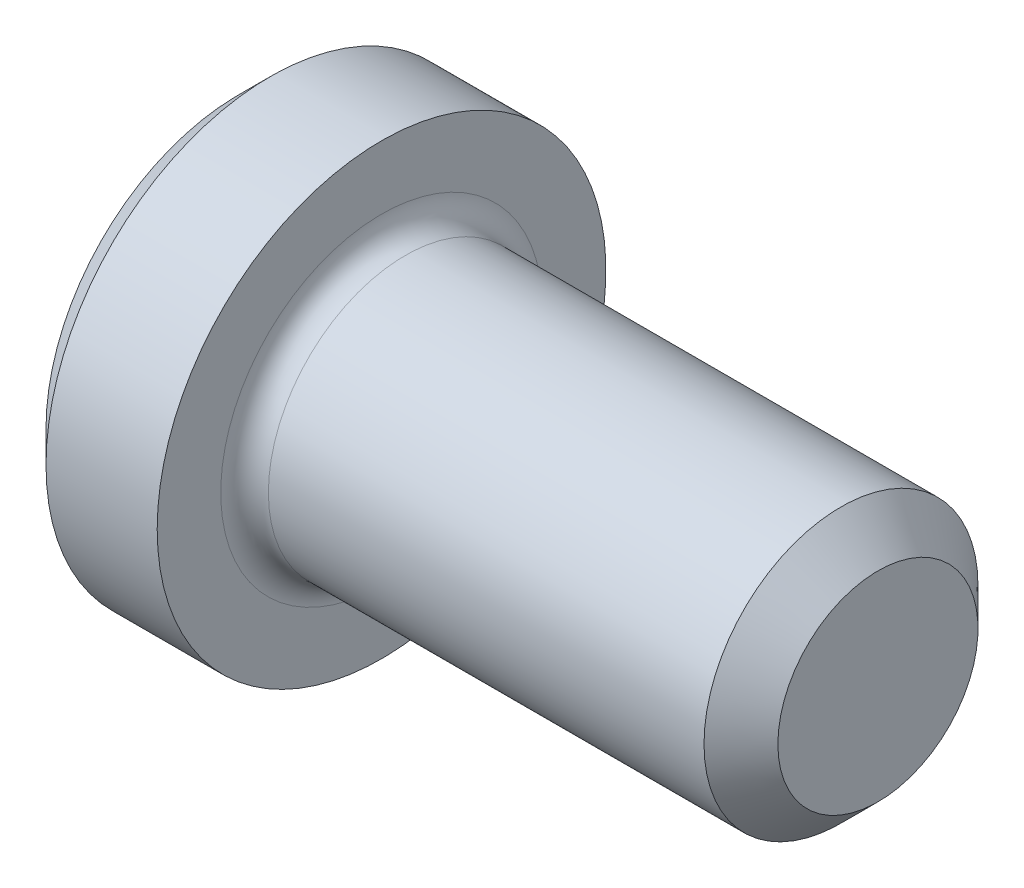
ISO-10303-21;
HEADER;
FILE_DESCRIPTION(('STEP AP214'),'2;1');
FILE_NAME('part.step','',(''),(''),'','','');
FILE_SCHEMA(('AUTOMOTIVE_DESIGN { 1 0 10303 214 1 1 1 1 }'));
ENDSEC;
DATA;
#1=APPLICATION_CONTEXT('core data for automotive mechanical design processes');
#2=APPLICATION_PROTOCOL_DEFINITION('international standard','automotive_design',2000,#1);
#3=PRODUCT_CONTEXT('',#1,'mechanical');
#4=PRODUCT('Part','Part','',(#3));
#5=PRODUCT_RELATED_PRODUCT_CATEGORY('part','',(#4));
#6=PRODUCT_DEFINITION_FORMATION('','',#4);
#7=PRODUCT_DEFINITION_CONTEXT('part definition',#1,'design');
#8=PRODUCT_DEFINITION('design','',#6,#7);
#9=PRODUCT_DEFINITION_SHAPE('','',#8);
#10=(LENGTH_UNIT() NAMED_UNIT(*) SI_UNIT(.MILLI.,.METRE.));
#11=(NAMED_UNIT(*) PLANE_ANGLE_UNIT() SI_UNIT($,.RADIAN.));
#12=(NAMED_UNIT(*) SI_UNIT($,.STERADIAN.) SOLID_ANGLE_UNIT());
#13=UNCERTAINTY_MEASURE_WITH_UNIT(LENGTH_MEASURE(1.E-05),#10,'distance_accuracy_value','');
#14=(GEOMETRIC_REPRESENTATION_CONTEXT(3) GLOBAL_UNCERTAINTY_ASSIGNED_CONTEXT((#13)) GLOBAL_UNIT_ASSIGNED_CONTEXT((#10,
#11,#12)) REPRESENTATION_CONTEXT('',''));
#15=CARTESIAN_POINT('',(0.,0.,0.));
#16=DIRECTION('',(0.,0.,1.));
#17=DIRECTION('',(1.,0.,0.));
#18=AXIS2_PLACEMENT_3D('',#15,#16,#17);
#19=CARTESIAN_POINT('',(0.,0.,0.));
#20=DIRECTION('',(-1.,0.,0.));
#21=DIRECTION('',(0.,0.,1.));
#22=AXIS2_PLACEMENT_3D('',#19,#20,#21);
#23=PLANE('',#22);
#24=DIRECTION('',(0.,-0.499999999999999,0.866025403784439));
#25=VECTOR('',#24,1.);
#26=CARTESIAN_POINT('',(0.,0.909211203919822,0.));
#27=LINE('',#26,#25);
#28=CARTESIAN_POINT('',(0.,0.909211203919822,0.));
#29=VERTEX_POINT('',#28);
#30=CARTESIAN_POINT('',(0.,0.454605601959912,0.787399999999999));
#31=VERTEX_POINT('',#30);
#32=EDGE_CURVE('E268',#29,#31,#27,.T.);
#33=ORIENTED_EDGE('',*,*,#32,.T.);
#34=DIRECTION('',(0.,1.,0.));
#35=VECTOR('',#34,1.);
#36=CARTESIAN_POINT('',(0.,-0.45460560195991,0.7874));
#37=LINE('',#36,#35);
#38=CARTESIAN_POINT('',(0.,-0.45460560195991,0.7874));
#39=VERTEX_POINT('',#38);
#40=EDGE_CURVE('E128',#39,#31,#37,.T.);
#41=ORIENTED_EDGE('',*,*,#40,.F.);
#42=DIRECTION('',(0.,-0.500000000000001,-0.866025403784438));
#43=VECTOR('',#42,1.);
#44=CARTESIAN_POINT('',(0.,-0.45460560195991,0.7874));
#45=LINE('',#44,#43);
#46=CARTESIAN_POINT('',(0.,-0.909211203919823,0.));
#47=VERTEX_POINT('',#46);
#48=EDGE_CURVE('E271',#39,#47,#45,.T.);
#49=ORIENTED_EDGE('',*,*,#48,.T.);
#50=DIRECTION('',(0.,0.499999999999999,-0.866025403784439));
#51=VECTOR('',#50,1.);
#52=CARTESIAN_POINT('',(0.,-0.909211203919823,0.));
#53=LINE('',#52,#51);
#54=CARTESIAN_POINT('',(0.,-0.454605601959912,-0.787399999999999));
#55=VERTEX_POINT('',#54);
#56=EDGE_CURVE('E274',#47,#55,#53,.T.);
#57=ORIENTED_EDGE('',*,*,#56,.T.);
#58=DIRECTION('',(0.,-1.,0.));
#59=VECTOR('',#58,1.);
#60=CARTESIAN_POINT('',(0.,0.45460560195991,-0.787400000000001));
#61=LINE('',#60,#59);
#62=CARTESIAN_POINT('',(0.,0.45460560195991,-0.787400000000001));
#63=VERTEX_POINT('',#62);
#64=EDGE_CURVE('E277',#63,#55,#61,.T.);
#65=ORIENTED_EDGE('',*,*,#64,.F.);
#66=DIRECTION('',(0.,-0.500000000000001,-0.866025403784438));
#67=VECTOR('',#66,1.);
#68=CARTESIAN_POINT('',(0.,0.909211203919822,0.));
#69=LINE('',#68,#67);
#70=EDGE_CURVE('E123',#29,#63,#69,.T.);
#71=ORIENTED_EDGE('',*,*,#70,.F.);
#72=EDGE_LOOP('',(#33,#41,#49,#57,#65,#71));
#73=FACE_BOUND('',#72,.T.);
#74=CARTESIAN_POINT('',(0.,0.,0.));
#75=DIRECTION('',(-1.,0.,0.));
#76=DIRECTION('',(0.,0.,1.));
#77=AXIS2_PLACEMENT_3D('',#74,#75,#76);
#78=CIRCLE('',#77,2.4638);
#79=CARTESIAN_POINT('',(0.,0.,2.4638));
#80=VERTEX_POINT('',#79);
#81=EDGE_CURVE('E152',#80,#80,#78,.T.);
#82=ORIENTED_EDGE('',*,*,#81,.T.);
#83=EDGE_LOOP('',(#82));
#84=FACE_BOUND('',#83,.T.);
#85=ADVANCED_FACE('F36',(#73,#84),#23,.T.);
#86=CARTESIAN_POINT('',(0.,0.,0.));
#87=DIRECTION('',(1.,0.,0.));
#88=DIRECTION('',(0.,0.,-1.));
#89=AXIS2_PLACEMENT_3D('',#86,#87,#88);
#90=CONICAL_SURFACE('',#89,2.4638,0.785398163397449);
#91=CARTESIAN_POINT('',(0.406400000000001,0.,0.));
#92=DIRECTION('',(-1.,0.,0.));
#93=DIRECTION('',(0.,0.,1.));
#94=AXIS2_PLACEMENT_3D('',#91,#92,#93);
#95=CIRCLE('',#94,2.8702);
#96=CARTESIAN_POINT('',(0.406400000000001,0.,2.8702));
#97=VERTEX_POINT('',#96);
#98=EDGE_CURVE('E149',#97,#97,#95,.T.);
#99=ORIENTED_EDGE('',*,*,#98,.T.);
#100=EDGE_LOOP('',(#99));
#101=FACE_BOUND('',#100,.T.);
#102=ORIENTED_EDGE('',*,*,#81,.F.);
#103=EDGE_LOOP('',(#102));
#104=FACE_BOUND('',#103,.T.);
#105=ADVANCED_FACE('F173',(#101,#104),#90,.T.);
#106=CARTESIAN_POINT('',(-5.43092971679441,0.,0.));
#107=DIRECTION('',(-1.,0.,0.));
#108=DIRECTION('',(0.,0.,1.));
#109=AXIS2_PLACEMENT_3D('',#106,#107,#108);
#110=CYLINDRICAL_SURFACE('',#109,2.8702);
#111=CARTESIAN_POINT('',(1.8288,0.,0.));
#112=DIRECTION('',(-1.,0.,0.));
#113=DIRECTION('',(0.,0.,1.));
#114=AXIS2_PLACEMENT_3D('',#111,#112,#113);
#115=CIRCLE('',#114,2.8702);
#116=CARTESIAN_POINT('',(1.8288,0.,2.8702));
#117=VERTEX_POINT('',#116);
#118=EDGE_CURVE('E146',#117,#117,#115,.T.);
#119=ORIENTED_EDGE('',*,*,#118,.T.);
#120=EDGE_LOOP('',(#119));
#121=FACE_BOUND('',#120,.T.);
#122=ORIENTED_EDGE('',*,*,#98,.F.);
#123=EDGE_LOOP('',(#122));
#124=FACE_BOUND('',#123,.T.);
#125=ADVANCED_FACE('F178',(#121,#124),#110,.T.);
#126=CARTESIAN_POINT('',(1.8288,2.8702,0.));
#127=DIRECTION('',(1.,0.,0.));
#128=DIRECTION('',(0.,0.,-1.));
#129=AXIS2_PLACEMENT_3D('',#126,#127,#128);
#130=PLANE('',#129);
#131=CARTESIAN_POINT('',(1.8288,0.,0.));
#132=DIRECTION('',(1.,0.,0.));
#133=DIRECTION('',(0.,0.,-1.));
#134=AXIS2_PLACEMENT_3D('',#131,#132,#133);
#135=CIRCLE('',#134,2.0574);
#136=CARTESIAN_POINT('',(1.8288,0.,-2.0574));
#137=VERTEX_POINT('',#136);
#138=EDGE_CURVE('E44',#137,#137,#135,.F.);
#139=ORIENTED_EDGE('',*,*,#138,.T.);
#140=EDGE_LOOP('',(#139));
#141=FACE_BOUND('',#140,.T.);
#142=ORIENTED_EDGE('',*,*,#118,.F.);
#143=EDGE_LOOP('',(#142));
#144=FACE_BOUND('',#143,.T.);
#145=ADVANCED_FACE('F157',(#141,#144),#130,.T.);
#146=CARTESIAN_POINT('',(-5.43092971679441,0.,0.));
#147=DIRECTION('',(-1.,0.,0.));
#148=DIRECTION('',(0.,0.,1.));
#149=AXIS2_PLACEMENT_3D('',#146,#147,#148);
#150=CYLINDRICAL_SURFACE('',#149,1.7526);
#151=CARTESIAN_POINT('',(2.1336,0.,0.));
#152=DIRECTION('',(1.,0.,0.));
#153=DIRECTION('',(0.,0.,-1.));
#154=AXIS2_PLACEMENT_3D('',#151,#152,#153);
#155=CIRCLE('',#154,1.7526);
#156=CARTESIAN_POINT('',(2.1336,0.,-1.7526));
#157=VERTEX_POINT('',#156);
#158=EDGE_CURVE('E11',#157,#157,#155,.T.);
#159=ORIENTED_EDGE('',*,*,#158,.T.);
#160=EDGE_LOOP('',(#159));
#161=FACE_BOUND('',#160,.T.);
#162=CARTESIAN_POINT('',(7.70636000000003,0.,0.));
#163=DIRECTION('',(-1.,0.,0.));
#164=DIRECTION('',(0.,0.,1.));
#165=AXIS2_PLACEMENT_3D('',#162,#163,#164);
#166=CIRCLE('',#165,1.7526);
#167=CARTESIAN_POINT('',(7.70636000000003,0.,1.7526));
#168=VERTEX_POINT('',#167);
#169=EDGE_CURVE('E143',#168,#168,#166,.T.);
#170=ORIENTED_EDGE('',*,*,#169,.T.);
#171=EDGE_LOOP('',(#170));
#172=FACE_BOUND('',#171,.T.);
#173=ADVANCED_FACE('F188',(#161,#172),#150,.T.);
#174=CARTESIAN_POINT('',(8.17879999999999,0.,0.));
#175=DIRECTION('',(-1.,0.,0.));
#176=DIRECTION('',(0.,0.,1.));
#177=AXIS2_PLACEMENT_3D('',#174,#175,#176);
#178=CONICAL_SURFACE('',#177,1.28016000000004,0.785398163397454);
#179=ORIENTED_EDGE('',*,*,#169,.F.);
#180=EDGE_LOOP('',(#179));
#181=FACE_BOUND('',#180,.T.);
#182=CARTESIAN_POINT('',(8.17879999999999,0.,0.));
#183=DIRECTION('',(-1.,0.,0.));
#184=DIRECTION('',(0.,0.,1.));
#185=AXIS2_PLACEMENT_3D('',#182,#183,#184);
#186=CIRCLE('',#185,1.28016000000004);
#187=CARTESIAN_POINT('',(8.17879999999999,0.,1.28016000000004));
#188=VERTEX_POINT('',#187);
#189=EDGE_CURVE('E139',#188,#188,#186,.T.);
#190=ORIENTED_EDGE('',*,*,#189,.T.);
#191=EDGE_LOOP('',(#190));
#192=FACE_BOUND('',#191,.T.);
#193=ADVANCED_FACE('F168',(#181,#192),#178,.T.);
#194=CARTESIAN_POINT('',(8.1788,1.28016000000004,0.));
#195=DIRECTION('',(1.,0.,0.));
#196=DIRECTION('',(0.,0.,-1.));
#197=AXIS2_PLACEMENT_3D('',#194,#195,#196);
#198=PLANE('',#197);
#199=ORIENTED_EDGE('',*,*,#189,.F.);
#200=EDGE_LOOP('',(#199));
#201=FACE_BOUND('',#200,.T.);
#202=ADVANCED_FACE('F161',(#201),#198,.T.);
#203=CARTESIAN_POINT('',(2.1336,0.,0.));
#204=DIRECTION('',(1.,0.,0.));
#205=DIRECTION('',(0.,0.,-1.));
#206=AXIS2_PLACEMENT_3D('',#203,#204,#205);
#207=TOROIDAL_SURFACE('',#206,2.0574,0.3048);
#208=ORIENTED_EDGE('',*,*,#158,.F.);
#209=EDGE_LOOP('',(#208));
#210=FACE_BOUND('',#209,.T.);
#211=ORIENTED_EDGE('',*,*,#138,.F.);
#212=EDGE_LOOP('',(#211));
#213=FACE_BOUND('',#212,.T.);
#214=ADVANCED_FACE('F38',(#210,#213),#207,.F.);
#215=CARTESIAN_POINT('',(1.5748,0.909211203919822,0.));
#216=DIRECTION('',(0.,-0.866025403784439,-0.499999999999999));
#217=DIRECTION('',(0.,0.499999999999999,-0.866025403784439));
#218=AXIS2_PLACEMENT_3D('',#215,#216,#217);
#219=PLANE('',#218);
#220=ORIENTED_EDGE('',*,*,#32,.F.);
#221=DIRECTION('',(-1.,0.,0.));
#222=VECTOR('',#221,1.);
#223=CARTESIAN_POINT('',(1.5748,0.909211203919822,0.));
#224=LINE('',#223,#222);
#225=CARTESIAN_POINT('',(1.5748,0.909211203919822,0.));
#226=VERTEX_POINT('',#225);
#227=EDGE_CURVE('E267',#226,#29,#224,.T.);
#228=ORIENTED_EDGE('',*,*,#227,.F.);
#229=DIRECTION('',(0.,-0.499999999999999,0.866025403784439));
#230=VECTOR('',#229,1.);
#231=CARTESIAN_POINT('',(1.5748,0.909211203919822,0.));
#232=LINE('',#231,#230);
#233=CARTESIAN_POINT('',(1.5748,0.681908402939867,0.393699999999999));
#234=VERTEX_POINT('',#233);
#235=EDGE_CURVE('E51',#226,#234,#232,.T.);
#236=ORIENTED_EDGE('',*,*,#235,.T.);
#237=CARTESIAN_POINT('',(1.5748,0.454605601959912,0.787399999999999));
#238=VERTEX_POINT('',#237);
#239=EDGE_CURVE('E109',#234,#238,#232,.T.);
#240=ORIENTED_EDGE('',*,*,#239,.T.);
#241=DIRECTION('',(-1.,0.,0.));
#242=VECTOR('',#241,1.);
#243=CARTESIAN_POINT('',(1.5748,0.454605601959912,0.787399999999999));
#244=LINE('',#243,#242);
#245=EDGE_CURVE('E121',#238,#31,#244,.T.);
#246=ORIENTED_EDGE('',*,*,#245,.T.);
#247=EDGE_LOOP('',(#220,#228,#236,#240,#246));
#248=FACE_BOUND('',#247,.T.);
#249=ADVANCED_FACE('F120',(#248),#219,.T.);
#250=CARTESIAN_POINT('',(1.5748,-0.45460560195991,0.7874));
#251=DIRECTION('',(0.,0.,1.));
#252=DIRECTION('',(0.,-1.,0.));
#253=AXIS2_PLACEMENT_3D('',#250,#251,#252);
#254=PLANE('',#253);
#255=ORIENTED_EDGE('',*,*,#40,.T.);
#256=ORIENTED_EDGE('',*,*,#245,.F.);
#257=DIRECTION('',(0.,1.,0.));
#258=VECTOR('',#257,1.);
#259=CARTESIAN_POINT('',(1.5748,-0.45460560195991,0.7874));
#260=LINE('',#259,#258);
#261=CARTESIAN_POINT('',(1.5748,0.,0.7874));
#262=VERTEX_POINT('',#261);
#263=EDGE_CURVE('E107',#262,#238,#260,.T.);
#264=ORIENTED_EDGE('',*,*,#263,.F.);
#265=CARTESIAN_POINT('',(1.5748,-0.45460560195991,0.7874));
#266=VERTEX_POINT('',#265);
#267=EDGE_CURVE('E117',#266,#262,#260,.T.);
#268=ORIENTED_EDGE('',*,*,#267,.F.);
#269=DIRECTION('',(-1.,0.,0.));
#270=VECTOR('',#269,1.);
#271=CARTESIAN_POINT('',(1.5748,-0.45460560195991,0.7874));
#272=LINE('',#271,#270);
#273=EDGE_CURVE('E130',#266,#39,#272,.T.);
#274=ORIENTED_EDGE('',*,*,#273,.T.);
#275=EDGE_LOOP('',(#255,#256,#264,#268,#274));
#276=FACE_BOUND('',#275,.T.);
#277=ADVANCED_FACE('F125',(#276),#254,.F.);
#278=CARTESIAN_POINT('',(1.5748,-0.45460560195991,0.7874));
#279=DIRECTION('',(0.,0.866025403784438,-0.500000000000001));
#280=DIRECTION('',(0.,0.500000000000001,0.866025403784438));
#281=AXIS2_PLACEMENT_3D('',#278,#279,#280);
#282=PLANE('',#281);
#283=ORIENTED_EDGE('',*,*,#48,.F.);
#284=ORIENTED_EDGE('',*,*,#273,.F.);
#285=DIRECTION('',(0.,-0.500000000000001,-0.866025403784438));
#286=VECTOR('',#285,1.);
#287=CARTESIAN_POINT('',(1.5748,-0.45460560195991,0.7874));
#288=LINE('',#287,#286);
#289=CARTESIAN_POINT('',(1.5748,-0.681908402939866,0.393700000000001));
#290=VERTEX_POINT('',#289);
#291=EDGE_CURVE('E248',#266,#290,#288,.T.);
#292=ORIENTED_EDGE('',*,*,#291,.T.);
#293=CARTESIAN_POINT('',(1.5748,-0.909211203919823,0.));
#294=VERTEX_POINT('',#293);
#295=EDGE_CURVE('E250',#290,#294,#288,.T.);
#296=ORIENTED_EDGE('',*,*,#295,.T.);
#297=DIRECTION('',(-1.,0.,0.));
#298=VECTOR('',#297,1.);
#299=CARTESIAN_POINT('',(1.5748,-0.909211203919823,0.));
#300=LINE('',#299,#298);
#301=EDGE_CURVE('E135',#294,#47,#300,.T.);
#302=ORIENTED_EDGE('',*,*,#301,.T.);
#303=EDGE_LOOP('',(#283,#284,#292,#296,#302));
#304=FACE_BOUND('',#303,.T.);
#305=ADVANCED_FACE('F200',(#304),#282,.T.);
#306=CARTESIAN_POINT('',(1.5748,-0.909211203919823,0.));
#307=DIRECTION('',(0.,0.866025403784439,0.499999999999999));
#308=DIRECTION('',(0.,-0.499999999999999,0.866025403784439));
#309=AXIS2_PLACEMENT_3D('',#306,#307,#308);
#310=PLANE('',#309);
#311=ORIENTED_EDGE('',*,*,#56,.F.);
#312=ORIENTED_EDGE('',*,*,#301,.F.);
#313=DIRECTION('',(0.,0.499999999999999,-0.866025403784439));
#314=VECTOR('',#313,1.);
#315=CARTESIAN_POINT('',(1.5748,-0.909211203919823,0.));
#316=LINE('',#315,#314);
#317=CARTESIAN_POINT('',(1.5748,-0.681908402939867,-0.393699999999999));
#318=VERTEX_POINT('',#317);
#319=EDGE_CURVE('E253',#294,#318,#316,.T.);
#320=ORIENTED_EDGE('',*,*,#319,.T.);
#321=CARTESIAN_POINT('',(1.5748,-0.454605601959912,-0.787399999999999));
#322=VERTEX_POINT('',#321);
#323=EDGE_CURVE('E257',#318,#322,#316,.T.);
#324=ORIENTED_EDGE('',*,*,#323,.T.);
#325=DIRECTION('',(-1.,0.,0.));
#326=VECTOR('',#325,1.);
#327=CARTESIAN_POINT('',(1.5748,-0.454605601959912,-0.787399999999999));
#328=LINE('',#327,#326);
#329=EDGE_CURVE('E286',#322,#55,#328,.T.);
#330=ORIENTED_EDGE('',*,*,#329,.T.);
#331=EDGE_LOOP('',(#311,#312,#320,#324,#330));
#332=FACE_BOUND('',#331,.T.);
#333=ADVANCED_FACE('F203',(#332),#310,.T.);
#334=CARTESIAN_POINT('',(1.5748,0.45460560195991,-0.787400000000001));
#335=DIRECTION('',(0.,0.,-1.));
#336=DIRECTION('',(0.,1.,0.));
#337=AXIS2_PLACEMENT_3D('',#334,#335,#336);
#338=PLANE('',#337);
#339=ORIENTED_EDGE('',*,*,#64,.T.);
#340=ORIENTED_EDGE('',*,*,#329,.F.);
#341=DIRECTION('',(0.,-1.,0.));
#342=VECTOR('',#341,1.);
#343=CARTESIAN_POINT('',(1.5748,0.45460560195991,-0.787400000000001));
#344=LINE('',#343,#342);
#345=CARTESIAN_POINT('',(1.5748,0.,-0.7874));
#346=VERTEX_POINT('',#345);
#347=EDGE_CURVE('E261',#346,#322,#344,.T.);
#348=ORIENTED_EDGE('',*,*,#347,.F.);
#349=CARTESIAN_POINT('',(1.5748,0.45460560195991,-0.787400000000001));
#350=VERTEX_POINT('',#349);
#351=EDGE_CURVE('E262',#350,#346,#344,.T.);
#352=ORIENTED_EDGE('',*,*,#351,.F.);
#353=DIRECTION('',(-1.,0.,0.));
#354=VECTOR('',#353,1.);
#355=CARTESIAN_POINT('',(1.5748,0.45460560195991,-0.787400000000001));
#356=LINE('',#355,#354);
#357=EDGE_CURVE('E283',#350,#63,#356,.T.);
#358=ORIENTED_EDGE('',*,*,#357,.T.);
#359=EDGE_LOOP('',(#339,#340,#348,#352,#358));
#360=FACE_BOUND('',#359,.T.);
#361=ADVANCED_FACE('F207',(#360),#338,.F.);
#362=CARTESIAN_POINT('',(1.5748,0.909211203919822,0.));
#363=DIRECTION('',(0.,0.866025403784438,-0.500000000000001));
#364=DIRECTION('',(0.,0.500000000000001,0.866025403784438));
#365=AXIS2_PLACEMENT_3D('',#362,#363,#364);
#366=PLANE('',#365);
#367=ORIENTED_EDGE('',*,*,#70,.T.);
#368=ORIENTED_EDGE('',*,*,#357,.F.);
#369=DIRECTION('',(0.,-0.500000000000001,-0.866025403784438));
#370=VECTOR('',#369,1.);
#371=CARTESIAN_POINT('',(1.5748,0.909211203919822,0.));
#372=LINE('',#371,#370);
#373=CARTESIAN_POINT('',(1.5748,0.681908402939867,-0.393700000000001));
#374=VERTEX_POINT('',#373);
#375=EDGE_CURVE('E265',#374,#350,#372,.T.);
#376=ORIENTED_EDGE('',*,*,#375,.F.);
#377=EDGE_CURVE('E239',#226,#374,#372,.T.);
#378=ORIENTED_EDGE('',*,*,#377,.F.);
#379=ORIENTED_EDGE('',*,*,#227,.T.);
#380=EDGE_LOOP('',(#367,#368,#376,#378,#379));
#381=FACE_BOUND('',#380,.T.);
#382=ADVANCED_FACE('F211',(#381),#366,.F.);
#383=CARTESIAN_POINT('',(1.5748,0.454605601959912,0.787399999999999));
#384=DIRECTION('',(-1.,0.,0.));
#385=DIRECTION('',(0.,0.,1.));
#386=AXIS2_PLACEMENT_3D('',#383,#384,#385);
#387=PLANE('',#386);
#388=CARTESIAN_POINT('',(1.5748,0.,0.));
#389=DIRECTION('',(-1.,0.,0.));
#390=DIRECTION('',(0.,0.,1.));
#391=AXIS2_PLACEMENT_3D('',#388,#389,#390);
#392=CIRCLE('',#391,0.7874);
#393=EDGE_CURVE('E129',#290,#262,#392,.T.);
#394=ORIENTED_EDGE('',*,*,#393,.F.);
#395=ORIENTED_EDGE('',*,*,#291,.F.);
#396=ORIENTED_EDGE('',*,*,#267,.T.);
#397=EDGE_LOOP('',(#394,#395,#396));
#398=FACE_BOUND('',#397,.T.);
#399=ADVANCED_FACE('F215',(#398),#387,.T.);
#400=EDGE_CURVE('E133',#318,#290,#392,.T.);
#401=ORIENTED_EDGE('',*,*,#400,.F.);
#402=ORIENTED_EDGE('',*,*,#319,.F.);
#403=ORIENTED_EDGE('',*,*,#295,.F.);
#404=EDGE_LOOP('',(#401,#402,#403));
#405=FACE_BOUND('',#404,.T.);
#406=ADVANCED_FACE('F218',(#405),#387,.T.);
#407=EDGE_CURVE('E292',#346,#318,#392,.T.);
#408=ORIENTED_EDGE('',*,*,#407,.F.);
#409=ORIENTED_EDGE('',*,*,#347,.T.);
#410=ORIENTED_EDGE('',*,*,#323,.F.);
#411=EDGE_LOOP('',(#408,#409,#410));
#412=FACE_BOUND('',#411,.T.);
#413=ADVANCED_FACE('F223',(#412),#387,.T.);
#414=EDGE_CURVE('E242',#374,#346,#392,.T.);
#415=ORIENTED_EDGE('',*,*,#414,.F.);
#416=ORIENTED_EDGE('',*,*,#375,.T.);
#417=ORIENTED_EDGE('',*,*,#351,.T.);
#418=EDGE_LOOP('',(#415,#416,#417));
#419=FACE_BOUND('',#418,.T.);
#420=ADVANCED_FACE('F230',(#419),#387,.T.);
#421=EDGE_CURVE('E140',#234,#374,#392,.T.);
#422=ORIENTED_EDGE('',*,*,#421,.F.);
#423=ORIENTED_EDGE('',*,*,#235,.F.);
#424=ORIENTED_EDGE('',*,*,#377,.T.);
#425=EDGE_LOOP('',(#422,#423,#424));
#426=FACE_BOUND('',#425,.T.);
#427=ADVANCED_FACE('F226',(#426),#387,.T.);
#428=EDGE_CURVE('E112',#262,#234,#392,.T.);
#429=ORIENTED_EDGE('',*,*,#428,.F.);
#430=ORIENTED_EDGE('',*,*,#263,.T.);
#431=ORIENTED_EDGE('',*,*,#239,.F.);
#432=EDGE_LOOP('',(#429,#430,#431));
#433=FACE_BOUND('',#432,.T.);
#434=ADVANCED_FACE('F108',(#433),#387,.T.);
#435=CARTESIAN_POINT('',(1.5748,0.,0.));
#436=DIRECTION('',(-1.,0.,0.));
#437=DIRECTION('',(0.,0.,1.));
#438=AXIS2_PLACEMENT_3D('',#435,#436,#437);
#439=CONICAL_SURFACE('',#438,0.7874,1.04719755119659);
#440=CARTESIAN_POINT('',(2.02940560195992,0.,0.));
#441=VERTEX_POINT('',#440);
#442=VERTEX_LOOP('',#441);
#443=FACE_BOUND('',#442,.T.);
#444=ORIENTED_EDGE('',*,*,#428,.T.);
#445=ORIENTED_EDGE('',*,*,#421,.T.);
#446=ORIENTED_EDGE('',*,*,#414,.T.);
#447=ORIENTED_EDGE('',*,*,#407,.T.);
#448=ORIENTED_EDGE('',*,*,#400,.T.);
#449=ORIENTED_EDGE('',*,*,#393,.T.);
#450=EDGE_LOOP('',(#444,#445,#446,#447,#448,#449));
#451=FACE_BOUND('',#450,.T.);
#452=ADVANCED_FACE('F195',(#443,#451),#439,.F.);
#453=CLOSED_SHELL('',(#85,#105,#125,#145,#173,#193,#202,#214,#249,#277,#305,#333,#361,#382,#399,
#406,#413,#420,#427,#434,#452));
#454=MANIFOLD_SOLID_BREP('B2',#453);
#455=ADVANCED_BREP_SHAPE_REPRESENTATION('',(#18,#454),#14);
#456=SHAPE_DEFINITION_REPRESENTATION(#9,#455);
ENDSEC;
END-ISO-10303-21;
